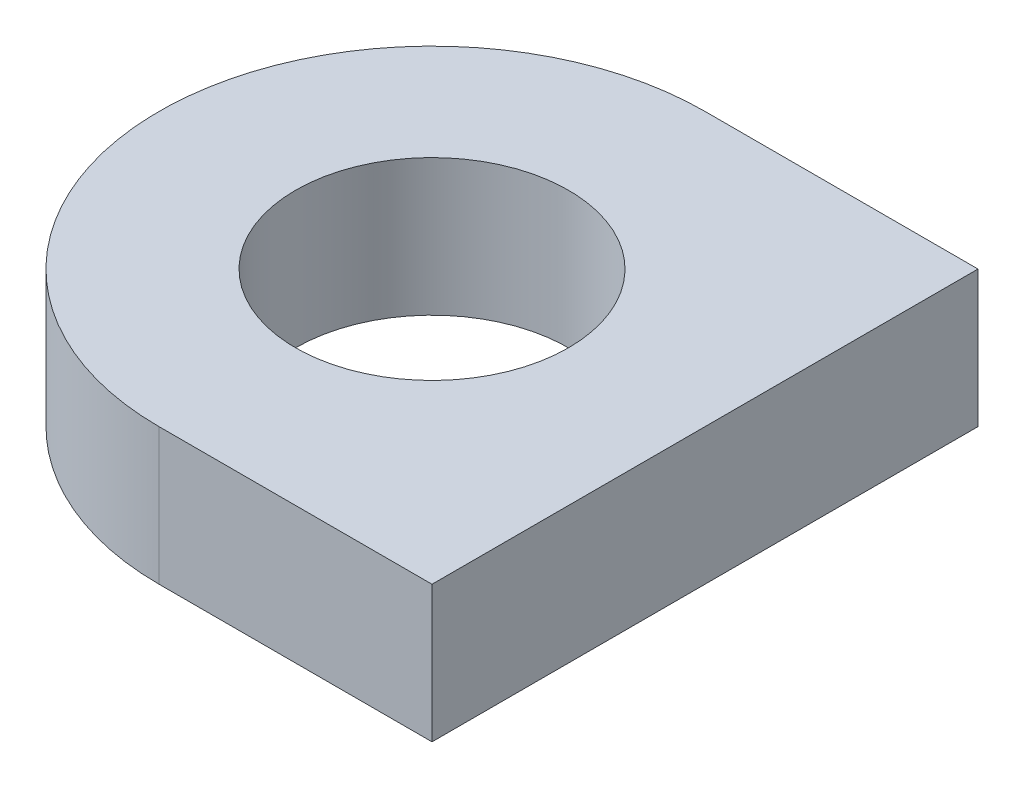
from build123d import *

# Parameters (mm, degrees)
BOSS_EXTRUDE1_DEPTH      = 4
BOSS_EXTRUDE1_DEPTH_BACK = 4
SKETCH1_W                = 8
SKETCH1_H                = 2
SKETCH3_R                = 2
CUT_EXTRUDE1_DEPTH       = 7.708203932
CUT_EXTRUDE2_DEPTH       = 7.708203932


with BuildPart() as part:
    # Sketch1 → Boss-Extrude1 (new, two sides: drawn at the far end of the back side and taken through both)
    with BuildSketch(Plane.XY.offset(-BOSS_EXTRUDE1_DEPTH_BACK)):
        with Locations((-1, 1)):
            Rectangle(SKETCH1_W, SKETCH1_H)
    extrude(amount=BOSS_EXTRUDE1_DEPTH + BOSS_EXTRUDE1_DEPTH_BACK)

    # Sketch3 → Cut-Extrude1 (cut, through all)
    with BuildSketch(Plane(origin=(0, 2, 0), x_dir=(1, 0, 0), z_dir=(0, 1, 0))):
        with Locations(Location((-1, 0, 0), (0, 0, 180))):
            Circle(SKETCH3_R)
    extrude(amount=-CUT_EXTRUDE1_DEPTH, mode=Mode.SUBTRACT)

    # Sketch4 → Cut-Extrude2 (cut, through all)
    with BuildSketch(Plane.XZ):
        with BuildLine():
            Line((-1, -4), (-7, -4))
            Line((-7, -4), (-7, 4))
            Line((-7, 4), (-1, 4))
            ThreePointArc((-1, 4), (-5, 0), (-1, -4))
        make_face()
    extrude(amount=-CUT_EXTRUDE2_DEPTH, mode=Mode.SUBTRACT)


solid = part.part
